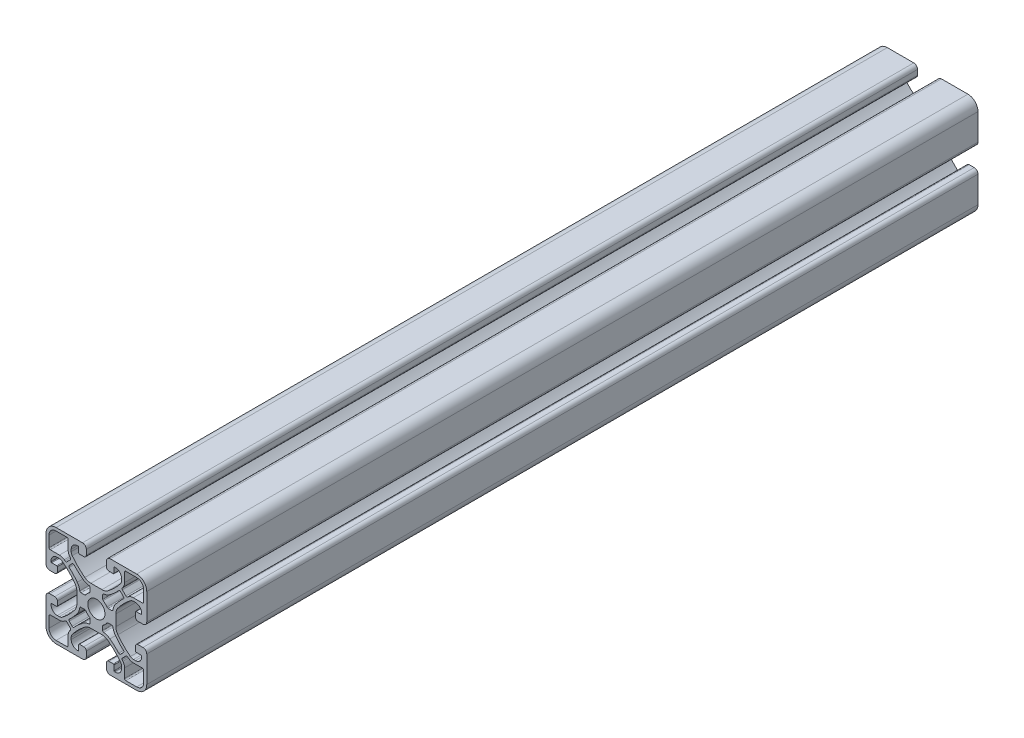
from build123d import *

# Parameters (mm, degrees)
ESQUISSE_PROFIL_R = 3.400000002
EXTRUSION1_DEPTH  = 330


with BuildPart() as part:
    # Esquisse profil → Extrusion1 (new body)
    with BuildSketch(Plane.XY):
        with BuildLine():
            Line((5.500000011, -20), (15.999999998, -20))
            ThreePointArc((15.999999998, -20), (18.82842711, -18.82842713), (20, -16.000000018))
            Line((20, -16.000000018), (20, -5.500000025))
            ThreePointArc((20, -5.500000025), (19.560660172, -4.439339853), (18.5, -4.000000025))
            Line((18.5, -4.000000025), (16.5, -4.000000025))
            ThreePointArc((16.5, -4.000000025), (15.792893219, -4.292893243), (15.5, -5.000000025))
            Line((15.5, -5.000000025), (15.5, -6.750000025))
            ThreePointArc((15.5, -6.750000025), (15.573223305, -6.92677672), (15.75, -7.000000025))
            Line((15.75, -7.000000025), (17.75, -7.000000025))
            ThreePointArc((17.75, -7.000000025), (17.926776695, -7.073223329), (18, -7.250000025))
            Line((18, -7.250000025), (18, -7.500000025))
            ThreePointArc((18, -7.500000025), (17.267766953, -9.267766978), (15.5, -10.000000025))
            Line((15.5, -10.000000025), (14.72036024, -10.000000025))
            ThreePointArc((14.72036024, -10.000000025), (14.083793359, -9.895991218), (13.51343504, -9.594782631))
            ThreePointArc((13.51343504, -9.594782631), (10.848996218, -7.2640298), (8.540476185, -4.580305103))
            ThreePointArc((8.540476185, -4.580305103), (7.952757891, -3.450415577), (7.75, -2.193056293))
            Line((7.75, -2.193056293), (7.75, 2.193056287))
            ThreePointArc((7.75, 2.193056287), (7.952757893, 3.450415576), (8.54047619, 4.580305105))
            ThreePointArc((8.54047619, 4.580305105), (10.848996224, 7.264029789), (13.513435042, 9.594782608))
            ThreePointArc((13.513435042, 9.594782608), (14.083793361, 9.895991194), (14.72036024, 10))
            Line((14.72036024, 10), (15.5, 10))
            ThreePointArc((15.5, 10), (17.267766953, 9.267766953), (18, 7.5))
            Line((18, 7.5), (18, 7.25))
            ThreePointArc((18, 7.25), (17.926776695, 7.073223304), (17.75, 7))
            Line((17.75, 7), (15.75, 7))
            ThreePointArc((15.75, 7), (15.573223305, 6.926776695), (15.5, 6.75))
            Line((15.5, 6.75), (15.5, 5))
            ThreePointArc((15.5, 5), (15.792893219, 4.292893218), (16.5, 4))
            Line((16.5, 4), (18.5, 4))
            ThreePointArc((18.5, 4), (19.560660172, 4.439339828), (20, 5.5))
            Line((20, 5.5), (20, 16.000000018))
            ThreePointArc((20, 16.000000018), (18.828427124, 18.828427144), (15.999999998, 20))
            Line((15.999999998, 20), (5.500000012, 20))
            ThreePointArc((5.500000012, 20), (4.43933984, 19.560660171), (4.000000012, 18.5))
            Line((4.000000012, 18.5), (4.000000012, 16.5))
            ThreePointArc((4.000000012, 16.5), (4.292893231, 15.792893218), (5.000000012, 15.5))
            Line((5.000000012, 15.5), (6.750000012, 15.5))
            ThreePointArc((6.750000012, 15.5), (6.926776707, 15.573223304), (7.000000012, 15.75))
            Line((7.000000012, 15.75), (7.000000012, 17.75))
            ThreePointArc((7.000000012, 17.75), (7.073223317, 17.926776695), (7.250000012, 18))
            Line((7.250000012, 18), (7.500000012, 18))
            ThreePointArc((7.500000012, 18), (9.267766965, 17.267766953), (10.000000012, 15.5))
            Line((10.000000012, 15.5), (10.000000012, 14.72036024))
            ThreePointArc((10.000000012, 14.72036024), (9.895991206, 14.083793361), (9.594782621, 13.513435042))
            ThreePointArc((9.594782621, 13.513435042), (7.264029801, 10.848996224), (4.580305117, 8.540476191))
            ThreePointArc((4.580305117, 8.540476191), (3.450415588, 7.952757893), (2.193056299, 7.75))
            Line((2.193056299, 7.75), (-2.193056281, 7.75))
            ThreePointArc((-2.193056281, 7.75), (-3.45041557, 7.952757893), (-4.580305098, 8.54047619))
            ThreePointArc((-4.580305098, 8.54047619), (-7.264029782, 10.848996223), (-9.594782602, 13.513435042))
            ThreePointArc((-9.594782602, 13.513435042), (-9.895991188, 14.08379336), (-9.999999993, 14.72036024))
            Line((-9.999999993, 14.72036024), (-9.999999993, 15.5))
            ThreePointArc((-9.999999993, 15.5), (-9.267766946, 17.267766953), (-7.499999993, 18))
            Line((-7.499999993, 18), (-7.249999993, 18))
            ThreePointArc((-7.249999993, 18), (-7.073223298, 17.926776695), (-6.999999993, 17.75))
            Line((-6.999999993, 17.75), (-6.999999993, 15.75))
            ThreePointArc((-6.999999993, 15.75), (-6.926776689, 15.573223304), (-6.749999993, 15.5))
            Line((-6.749999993, 15.5), (-4.999999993, 15.5))
            ThreePointArc((-4.999999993, 15.5), (-4.292893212, 15.792893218), (-3.999999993, 16.5))
            Line((-3.999999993, 16.5), (-3.999999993, 18.5))
            ThreePointArc((-3.999999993, 18.5), (-4.439339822, 19.560660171), (-5.499999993, 20))
            Line((-5.499999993, 20), (-15.999999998, 20))
            ThreePointArc((-15.999999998, 20), (-18.82842711, 18.82842713), (-20, 16.000000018))
            Line((-20, 16.000000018), (-20, 5.499999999))
            ThreePointArc((-20, 5.499999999), (-19.560660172, 4.439339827), (-18.5, 3.999999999))
            Line((-18.5, 3.999999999), (-16.5, 3.999999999))
            ThreePointArc((-16.5, 3.999999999), (-15.792893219, 4.292893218), (-15.5, 4.999999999))
            Line((-15.5, 4.999999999), (-15.5, 6.749999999))
            ThreePointArc((-15.5, 6.749999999), (-15.573223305, 6.926776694), (-15.75, 6.999999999))
            Line((-15.75, 6.999999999), (-17.75, 6.999999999))
            ThreePointArc((-17.75, 6.999999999), (-17.926776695, 7.073223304), (-18, 7.249999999))
            Line((-18, 7.249999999), (-18, 7.499999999))
            ThreePointArc((-18, 7.499999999), (-17.267766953, 9.267766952), (-15.5, 9.999999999))
            Line((-15.5, 9.999999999), (-14.72036024, 9.999999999))
            ThreePointArc((-14.72036024, 9.999999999), (-14.083793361, 9.895991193), (-13.513435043, 9.594782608))
            ThreePointArc((-13.513435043, 9.594782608), (-10.848996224, 7.264029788), (-8.540476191, 4.580305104))
            ThreePointArc((-8.540476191, 4.580305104), (-7.952757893, 3.450415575), (-7.75, 2.193056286))
            Line((-7.75, 2.193056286), (-7.75, -2.193056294))
            ThreePointArc((-7.75, -2.193056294), (-7.952757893, -3.450415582), (-8.54047619, -4.580305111))
            ThreePointArc((-8.54047619, -4.580305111), (-10.848996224, -7.264029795), (-13.513435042, -9.594782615))
            ThreePointArc((-13.513435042, -9.594782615), (-14.083793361, -9.8959912), (-14.72036024, -10.000000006))
            Line((-14.72036024, -10.000000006), (-15.5, -10.000000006))
            ThreePointArc((-15.5, -10.000000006), (-17.267766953, -9.267766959), (-18, -7.500000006))
            Line((-18, -7.500000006), (-18, -7.250000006))
            ThreePointArc((-18, -7.250000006), (-17.926776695, -7.073223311), (-17.75, -7.000000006))
            Line((-17.75, -7.000000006), (-15.75, -7.000000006))
            ThreePointArc((-15.75, -7.000000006), (-15.573223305, -6.926776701), (-15.5, -6.750000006))
            Line((-15.5, -6.750000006), (-15.5, -5.000000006))
            ThreePointArc((-15.5, -5.000000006), (-15.792893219, -4.292893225), (-16.5, -4.000000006))
            Line((-16.5, -4.000000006), (-18.5, -4.000000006))
            ThreePointArc((-18.5, -4.000000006), (-19.560660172, -4.439339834), (-20, -5.500000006))
            Line((-20, -5.500000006), (-20, -15.999999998))
            ThreePointArc((-20, -15.999999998), (-18.828427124, -18.828427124), (-15.999999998, -20))
            Line((-15.999999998, -20), (-5.499999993, -20))
            ThreePointArc((-5.499999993, -20), (-4.439339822, -19.560660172), (-3.999999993, -18.5))
            Line((-3.999999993, -18.5), (-3.999999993, -16.5))
            ThreePointArc((-3.999999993, -16.5), (-4.292893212, -15.792893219), (-4.999999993, -15.5))
            Line((-4.999999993, -15.5), (-6.749999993, -15.5))
            ThreePointArc((-6.749999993, -15.5), (-6.926776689, -15.573223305), (-6.999999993, -15.75))
            Line((-6.999999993, -15.75), (-6.999999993, -17.75))
            ThreePointArc((-6.999999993, -17.75), (-7.073223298, -17.926776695), (-7.249999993, -18))
            Line((-7.249999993, -18), (-7.499999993, -18))
            ThreePointArc((-7.499999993, -18), (-9.267766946, -17.267766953), (-9.999999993, -15.5))
            Line((-9.999999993, -15.5), (-9.999999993, -14.72036024))
            ThreePointArc((-9.999999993, -14.72036024), (-9.895991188, -14.083793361), (-9.594782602, -13.513435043))
            ThreePointArc((-9.594782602, -13.513435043), (-7.264029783, -10.848996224), (-4.580305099, -8.540476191))
            ThreePointArc((-4.580305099, -8.540476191), (-3.45041557, -7.952757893), (-2.193056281, -7.75))
            Line((-2.193056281, -7.75), (2.193056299, -7.75))
            ThreePointArc((2.193056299, -7.75), (3.450415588, -7.952757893), (4.580305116, -8.54047619))
            ThreePointArc((4.580305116, -8.54047619), (7.264029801, -10.848996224), (9.59478262, -13.513435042))
            ThreePointArc((9.59478262, -13.513435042), (9.895991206, -14.083793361), (10.000000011, -14.72036024))
            Line((10.000000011, -14.72036024), (10.000000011, -15.5))
            ThreePointArc((10.000000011, -15.5), (9.267766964, -17.267766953), (7.500000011, -18))
            Line((7.500000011, -18), (7.250000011, -18))
            ThreePointArc((7.250000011, -18), (7.073223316, -17.926776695), (7.000000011, -17.75))
            Line((7.000000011, -17.75), (7.000000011, -15.75))
            ThreePointArc((7.000000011, -15.75), (6.926776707, -15.573223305), (6.750000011, -15.5))
            Line((6.750000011, -15.5), (5.000000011, -15.5))
            ThreePointArc((5.000000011, -15.5), (4.29289323, -15.792893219), (4.000000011, -16.5))
            Line((4.000000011, -16.5), (4.000000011, -18.5))
            ThreePointArc((4.000000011, -18.5), (4.43933984, -19.560660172), (5.500000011, -20))
        make_face()
        Circle(ESQUISSE_PROFIL_R, mode=Mode.SUBTRACT)
        with BuildLine():
            Line((11.699666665, 18.8), (15.999999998, 18.8))
            ThreePointArc((15.999999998, 18.8), (17.979898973, 17.979898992), (18.8, 16.000000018))
            Line((18.8, 16.000000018), (18.8, 11.699999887))
            ThreePointArc((18.8, 11.699999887), (18.653553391, 11.346446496), (18.3, 11.199999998))
            Line((18.3, 11.199999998), (14.670026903, 11.199999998))
            ThreePointArc((14.670026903, 11.199999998), (13.651519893, 11.033585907), (12.738946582, 10.551652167))
            Line((12.738946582, 10.551652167), (12.395722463, 10.287411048))
            ThreePointArc((12.395722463, 10.287411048), (12.057202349, 10.181979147), (11.733887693, 10.327510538))
            Line((11.733887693, 10.327510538), (10.327177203, 11.734221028))
            ThreePointArc((10.327177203, 11.734221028), (10.181645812, 12.057535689), (10.287077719, 12.396055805))
            Line((10.287077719, 12.396055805), (10.551318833, 12.739279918))
            ThreePointArc((10.551318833, 12.739279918), (11.033252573, 13.651853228), (11.199666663, 14.670360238))
            Line((11.199666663, 14.670360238), (11.199666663, 18.299999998))
            ThreePointArc((11.199666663, 18.299999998), (11.346113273, 18.65355339), (11.699666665, 18.8))
        make_face(mode=Mode.SUBTRACT)
        with BuildLine():
            Line((-11.199666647, 14.669919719), (-11.199666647, 18.299999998))
            ThreePointArc((-11.199666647, 18.299999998), (-11.346113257, 18.65355339), (-11.699666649, 18.8))
            Line((-11.699666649, 18.8), (-15.999999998, 18.8))
            ThreePointArc((-15.999999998, 18.8), (-17.979898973, 17.979898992), (-18.8, 16.000000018))
            Line((-18.8, 16.000000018), (-18.8, 11.699999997))
            ThreePointArc((-18.8, 11.699999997), (-18.653553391, 11.346446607), (-18.3, 11.199999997))
            Line((-18.3, 11.199999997), (-14.67036024, 11.199999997))
            ThreePointArc((-14.67036024, 11.199999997), (-13.65185323, 11.033585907), (-12.739279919, 10.551652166))
            Line((-12.739279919, 10.551652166), (-12.3960558, 10.287411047))
            ThreePointArc((-12.3960558, 10.287411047), (-12.057535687, 10.181979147), (-11.73422103, 10.327510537))
            Line((-11.73422103, 10.327510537), (-10.32751054, 11.734221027))
            ThreePointArc((-10.32751054, 11.734221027), (-10.181979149, 12.057535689), (-10.287411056, 12.396055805))
            Line((-10.287411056, 12.396055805), (-10.551651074, 12.739278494))
            ThreePointArc((-10.551651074, 12.739278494), (-11.033340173, 13.651673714), (-11.199666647, 14.669919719))
        make_face(mode=Mode.SUBTRACT)
        with BuildLine():
            Line((-2.500000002, 6.098239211), (-2.500000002, 4.609772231))
            ThreePointArc((-2.500000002, 4.609772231), (-2.560475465, 4.371406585), (-2.727272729, 4.19070203))
            ThreePointArc((-2.727272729, 4.19070203), (-3.535533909, 3.535533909), (-4.19070203, 2.727272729))
            ThreePointArc((-4.19070203, 2.727272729), (-4.371406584, 2.560475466), (-4.609772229, 2.500000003))
            Line((-4.609772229, 2.500000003), (-6.098239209, 2.500000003))
            ThreePointArc((-6.098239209, 2.500000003), (-6.428045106, 2.62419677), (-6.594007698, 2.935087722))
            ThreePointArc((-6.594007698, 2.935087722), (-6.934262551, 4.221803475), (-7.589999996, 5.380000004))
            ThreePointArc((-7.589999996, 5.380000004), (-9.089852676, 7.202595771), (-10.747651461, 8.882809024))
            ThreePointArc((-10.747651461, 8.882809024), (-10.907820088, 9.24007063), (-10.761465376, 9.603209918))
            Line((-10.761465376, 9.603209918), (-9.603209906, 10.761465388))
            ThreePointArc((-9.603209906, 10.761465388), (-9.240070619, 10.907820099), (-8.882809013, 10.747651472))
            ThreePointArc((-8.882809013, 10.747651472), (-7.202595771, 9.089852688), (-5.380000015, 7.590000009))
            ThreePointArc((-5.380000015, 7.590000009), (-4.221803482, 6.934262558), (-2.935087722, 6.594007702))
            ThreePointArc((-2.935087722, 6.594007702), (-2.624196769, 6.428045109), (-2.500000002, 6.098239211))
        make_face(mode=Mode.SUBTRACT)
        with BuildLine():
            Line((-10.761465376, -9.603209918), (-9.603209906, -10.761465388))
            ThreePointArc((-9.603209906, -10.761465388), (-9.240070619, -10.907820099), (-8.882809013, -10.747651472))
            ThreePointArc((-8.882809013, -10.747651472), (-7.202595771, -9.089852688), (-5.380000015, -7.590000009))
            ThreePointArc((-5.380000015, -7.590000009), (-4.221803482, -6.934262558), (-2.935087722, -6.594007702))
            ThreePointArc((-2.935087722, -6.594007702), (-2.624196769, -6.428045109), (-2.500000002, -6.098239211))
            Line((-2.500000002, -6.098239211), (-2.500000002, -4.609772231))
            ThreePointArc((-2.500000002, -4.609772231), (-2.560475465, -4.371406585), (-2.727272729, -4.19070203))
            ThreePointArc((-2.727272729, -4.19070203), (-3.535533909, -3.535533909), (-4.19070203, -2.727272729))
            ThreePointArc((-4.19070203, -2.727272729), (-4.371406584, -2.560475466), (-4.609772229, -2.500000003))
            Line((-4.609772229, -2.500000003), (-6.098239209, -2.500000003))
            ThreePointArc((-6.098239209, -2.500000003), (-6.428045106, -2.62419677), (-6.594007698, -2.935087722))
            ThreePointArc((-6.594007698, -2.935087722), (-6.934262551, -4.221803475), (-7.589999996, -5.380000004))
            ThreePointArc((-7.589999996, -5.380000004), (-9.089852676, -7.202595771), (-10.747651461, -8.882809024))
            ThreePointArc((-10.747651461, -8.882809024), (-10.907820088, -9.24007063), (-10.761465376, -9.603209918))
        make_face(mode=Mode.SUBTRACT)
        with BuildLine():
            Line((-11.699999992, -18.8), (-15.999999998, -18.8))
            ThreePointArc((-15.999999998, -18.8), (-17.979898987, -17.979898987), (-18.8, -15.999999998))
            Line((-18.8, -15.999999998), (-18.8, -11.700000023))
            ThreePointArc((-18.8, -11.700000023), (-18.653553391, -11.346446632), (-18.3, -11.200000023))
            Line((-18.3, -11.200000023), (-14.67036024, -11.200000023))
            ThreePointArc((-14.67036024, -11.200000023), (-13.65185323, -11.033585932), (-12.739279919, -10.551652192))
            Line((-12.739279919, -10.551652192), (-12.3960558, -10.287411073))
            ThreePointArc((-12.3960558, -10.287411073), (-12.057535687, -10.181979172), (-11.73422103, -10.327510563))
            Line((-11.73422103, -10.327510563), (-10.32751054, -11.734221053))
            ThreePointArc((-10.32751054, -11.734221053), (-10.181979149, -12.057535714), (-10.287411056, -12.39605583))
            Line((-10.287411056, -12.39605583), (-10.55165217, -12.739279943))
            ThreePointArc((-10.55165217, -12.739279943), (-11.033585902, -13.651853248), (-11.19999999, -14.670360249))
            Line((-11.19999999, -14.670360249), (-11.19999999, -18.299999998))
            ThreePointArc((-11.19999999, -18.299999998), (-11.3464466, -18.65355339), (-11.699999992, -18.8))
        make_face(mode=Mode.SUBTRACT)
        with BuildLine():
            Line((9.603209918, 10.761465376), (10.761465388, 9.603209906))
            ThreePointArc((10.761465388, 9.603209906), (10.907820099, 9.240070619), (10.747651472, 8.882809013))
            ThreePointArc((10.747651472, 8.882809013), (9.089852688, 7.202595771), (7.590000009, 5.380000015))
            ThreePointArc((7.590000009, 5.380000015), (6.934262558, 4.221803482), (6.594007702, 2.935087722))
            ThreePointArc((6.594007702, 2.935087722), (6.428045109, 2.624196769), (6.098239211, 2.500000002))
            Line((6.098239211, 2.500000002), (4.609772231, 2.500000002))
            ThreePointArc((4.609772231, 2.500000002), (4.371406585, 2.560475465), (4.19070203, 2.727272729))
            ThreePointArc((4.19070203, 2.727272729), (3.535533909, 3.535533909), (2.727272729, 4.19070203))
            ThreePointArc((2.727272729, 4.19070203), (2.560475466, 4.371406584), (2.500000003, 4.609772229))
            Line((2.500000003, 4.609772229), (2.500000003, 6.098239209))
            ThreePointArc((2.500000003, 6.098239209), (2.62419677, 6.428045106), (2.935087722, 6.594007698))
            ThreePointArc((2.935087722, 6.594007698), (4.221803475, 6.934262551), (5.380000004, 7.589999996))
            ThreePointArc((5.380000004, 7.589999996), (7.202595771, 9.089852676), (8.882809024, 10.747651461))
            ThreePointArc((8.882809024, 10.747651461), (9.24007063, 10.907820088), (9.603209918, 10.761465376))
        make_face(mode=Mode.SUBTRACT)
        with BuildLine():
            Line((2.500000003, -4.609772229), (2.500000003, -6.098239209))
            ThreePointArc((2.500000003, -6.098239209), (2.62419677, -6.428045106), (2.935087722, -6.594007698))
            ThreePointArc((2.935087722, -6.594007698), (4.221803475, -6.934262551), (5.380000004, -7.589999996))
            ThreePointArc((5.380000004, -7.589999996), (7.202595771, -9.089852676), (8.882809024, -10.747651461))
            ThreePointArc((8.882809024, -10.747651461), (9.24007063, -10.907820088), (9.603209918, -10.761465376))
            Line((9.603209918, -10.761465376), (10.761465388, -9.603209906))
            ThreePointArc((10.761465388, -9.603209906), (10.907820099, -9.240070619), (10.747651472, -8.882809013))
            ThreePointArc((10.747651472, -8.882809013), (9.089852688, -7.202595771), (7.590000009, -5.380000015))
            ThreePointArc((7.590000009, -5.380000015), (6.934262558, -4.221803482), (6.594007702, -2.935087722))
            ThreePointArc((6.594007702, -2.935087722), (6.428045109, -2.624196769), (6.098239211, -2.500000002))
            Line((6.098239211, -2.500000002), (4.609772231, -2.500000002))
            ThreePointArc((4.609772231, -2.500000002), (4.371406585, -2.560475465), (4.19070203, -2.727272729))
            ThreePointArc((4.19070203, -2.727272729), (3.535533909, -3.535533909), (2.727272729, -4.19070203))
            ThreePointArc((2.727272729, -4.19070203), (2.560475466, -4.371406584), (2.500000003, -4.609772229))
        make_face(mode=Mode.SUBTRACT)
        with BuildLine():
            Line((11.199666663, -14.670360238), (11.199666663, -18.299999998))
            ThreePointArc((11.199666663, -18.299999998), (11.346113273, -18.65355339), (11.699666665, -18.8))
            Line((11.699666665, -18.8), (15.999999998, -18.8))
            ThreePointArc((15.999999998, -18.8), (17.979898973, -17.979898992), (18.8, -16.000000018))
            Line((18.8, -16.000000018), (18.8, -11.699999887))
            ThreePointArc((18.8, -11.699999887), (18.653553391, -11.346446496), (18.3, -11.199999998))
            Line((18.3, -11.199999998), (14.670026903, -11.199999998))
            ThreePointArc((14.670026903, -11.199999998), (13.651519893, -11.033585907), (12.738946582, -10.551652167))
            Line((12.738946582, -10.551652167), (12.395722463, -10.287411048))
            ThreePointArc((12.395722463, -10.287411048), (12.057202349, -10.181979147), (11.733887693, -10.327510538))
            Line((11.733887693, -10.327510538), (10.327177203, -11.734221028))
            ThreePointArc((10.327177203, -11.734221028), (10.181645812, -12.057535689), (10.287077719, -12.396055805))
            Line((10.287077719, -12.396055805), (10.551318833, -12.739279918))
            ThreePointArc((10.551318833, -12.739279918), (11.033252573, -13.651853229), (11.199666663, -14.670360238))
        make_face(mode=Mode.SUBTRACT)
    extrude(amount=EXTRUSION1_DEPTH)


solid = part.part
